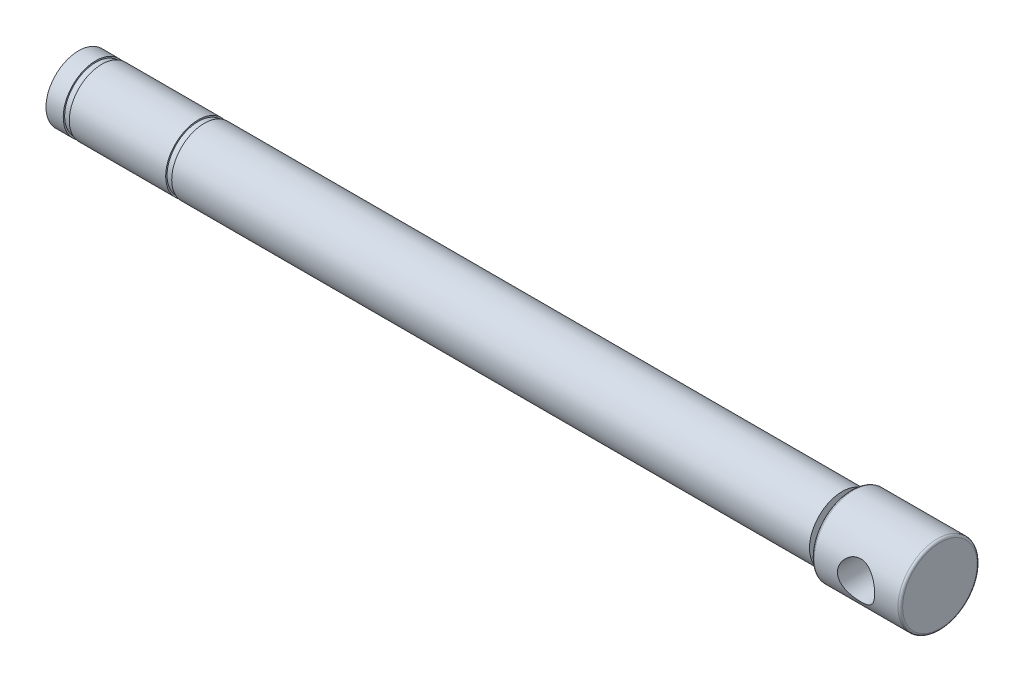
from build123d import *

# Parameters (mm, degrees)
CUT_EXTRUDE1_DEPTH      = 186.390129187
CUT_EXTRUDE1_DEPTH_BACK = 186.390129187
SKETCH2_R               = 4
FILLET1_R               = 0.5


with BuildPart() as part:
    # Sketch1 → Revolve1 (revolve)
    with BuildSketch(Plane.XY, mode=Mode.PRIVATE) as revolve1_sk:
        Polygon((0, 0), (0, 8.5), (-19, 8.5), (-19, 4), (-21, 4), (-21, 7), (-158, 7), (-158, 6.7), (-159.3, 6.7), (-159.3, 7), (-180, 7), (-180, 6.7), (-181.3, 6.7), (-181.3, 7), (-185, 7), (-185, 0), align=None)
    revolve(revolve1_sk.sketch.rotate(Axis((-788.991534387, 0, 0), (1, 0, 0)), 90), axis=Axis((-788.991534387, 0, 0), (1, 0, 0)))

    # Sketch2 → Cut-Extrude1 (cut, two sides: drawn at the far end of the back side and taken through both)
    with BuildSketch(Plane.XY.offset(-CUT_EXTRUDE1_DEPTH_BACK)):
        with Locations((-9.5, 0)):
            Circle(SKETCH2_R)
    extrude(amount=CUT_EXTRUDE1_DEPTH + CUT_EXTRUDE1_DEPTH_BACK, mode=Mode.SUBTRACT)

    # Fillet1
    fillet1_edges = [part.edges().sort_by_distance(p)[0] for p in [
        (-19, 0, -8.5),
        (0, 0, -8.5),
    ]]
    fillet(fillet1_edges, radius=FILLET1_R)


solid = part.part
